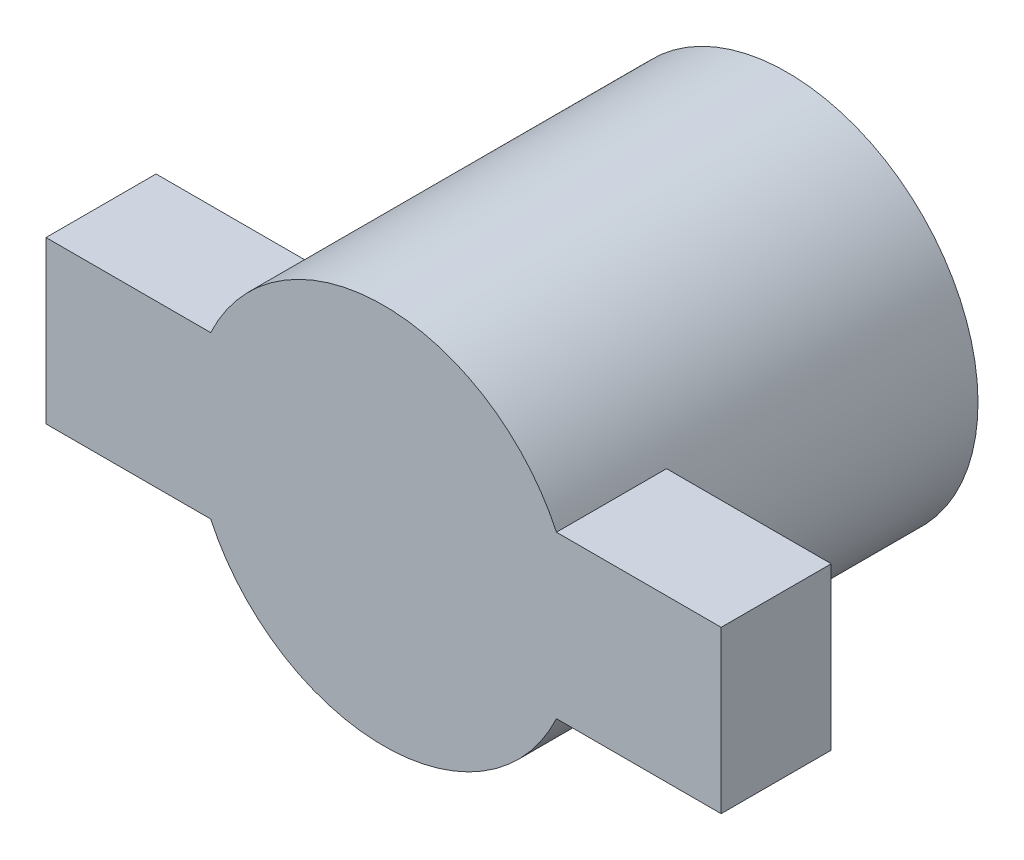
from build123d import *

# Parameters (mm, degrees)
BOSS_EXTRUDE1_DEPTH = 1.905
SKETCH2_R           = 3.302
BOSS_EXTRUDE2_DEPTH = 5.08


with BuildPart() as part:
    # Sketch1 → Boss-Extrude1 (new body)
    with BuildSketch(Plane.XY):
        with BuildLine():
            Line((41.312, -4.863), (38.461921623, -4.863))
            ThreePointArc((38.461921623, -4.863), (35.47, -2.958), (32.478078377, -4.863))
            Line((32.478078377, -4.863), (29.628, -4.863))
            Line((29.628, -4.863), (29.628, -7.657))
            Line((29.628, -7.657), (32.478078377, -7.657))
            ThreePointArc((32.478078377, -7.657), (35.47, -9.562), (38.461921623, -7.657))
            Line((38.461921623, -7.657), (41.312, -7.657))
            Line((41.312, -7.657), (41.312, -4.863))
        make_face()
    extrude(amount=-BOSS_EXTRUDE1_DEPTH)

    # Sketch2 → Boss-Extrude2 (add)
    with BuildSketch(Plane(origin=(0, 0, -1.905), x_dir=(-1, 0, 0), z_dir=(0, 0, -1))):
        with Locations(Location((-35.47, -6.26, 0), (0, 0, 154.971000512))):
            Circle(SKETCH2_R)
    extrude(amount=BOSS_EXTRUDE2_DEPTH)


solid = part.part
